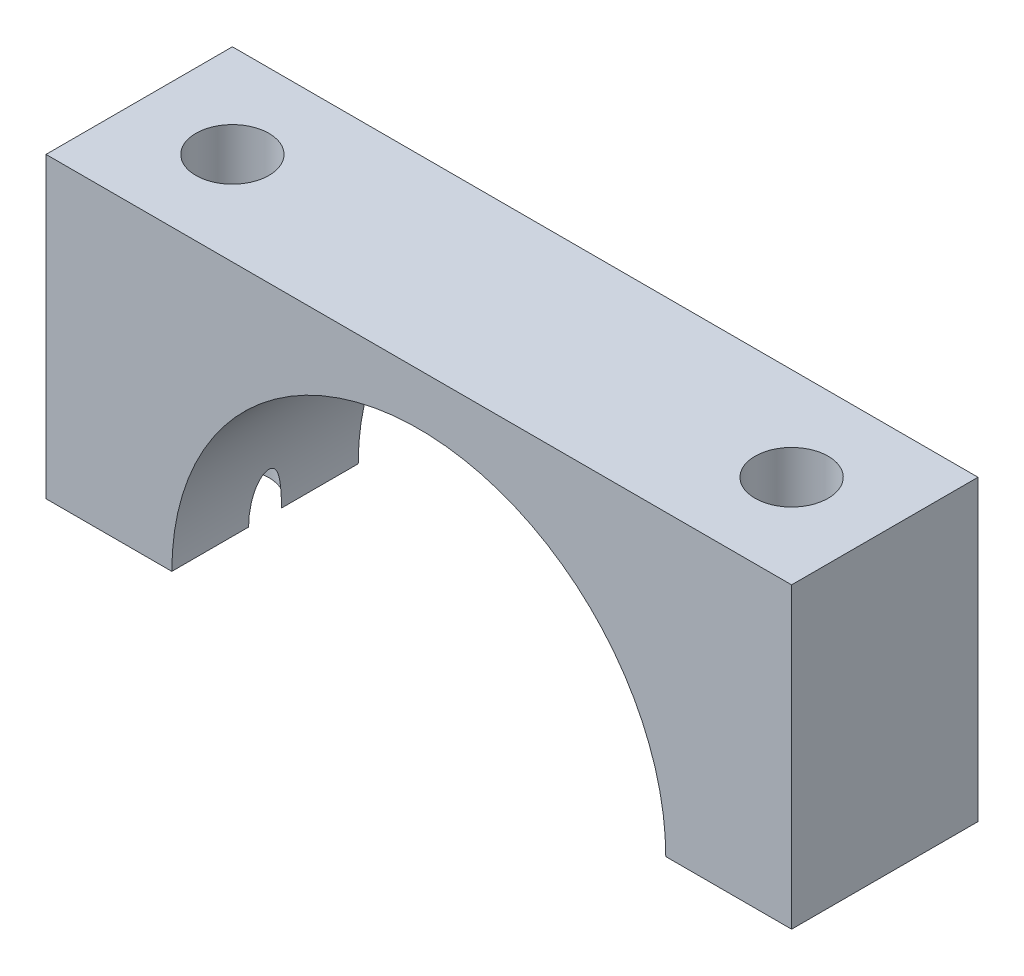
ISO-10303-21;
HEADER;
FILE_DESCRIPTION(('STEP AP214'),'2;1');
FILE_NAME('part.step','',(''),(''),'','','');
FILE_SCHEMA(('AUTOMOTIVE_DESIGN { 1 0 10303 214 1 1 1 1 }'));
ENDSEC;
DATA;
#1=APPLICATION_CONTEXT('core data for automotive mechanical design processes');
#2=APPLICATION_PROTOCOL_DEFINITION('international standard','automotive_design',2000,#1);
#3=PRODUCT_CONTEXT('',#1,'mechanical');
#4=PRODUCT('Part','Part','',(#3));
#5=PRODUCT_RELATED_PRODUCT_CATEGORY('part','',(#4));
#6=PRODUCT_DEFINITION_FORMATION('','',#4);
#7=PRODUCT_DEFINITION_CONTEXT('part definition',#1,'design');
#8=PRODUCT_DEFINITION('design','',#6,#7);
#9=PRODUCT_DEFINITION_SHAPE('','',#8);
#10=(LENGTH_UNIT() NAMED_UNIT(*) SI_UNIT(.MILLI.,.METRE.));
#11=(NAMED_UNIT(*) PLANE_ANGLE_UNIT() SI_UNIT($,.RADIAN.));
#12=(NAMED_UNIT(*) SI_UNIT($,.STERADIAN.) SOLID_ANGLE_UNIT());
#13=UNCERTAINTY_MEASURE_WITH_UNIT(LENGTH_MEASURE(1.E-05),#10,'distance_accuracy_value','');
#14=(GEOMETRIC_REPRESENTATION_CONTEXT(3) GLOBAL_UNCERTAINTY_ASSIGNED_CONTEXT((#13)) GLOBAL_UNIT_ASSIGNED_CONTEXT((#10,
#11,#12)) REPRESENTATION_CONTEXT('',''));
#15=CARTESIAN_POINT('',(0.,0.,0.));
#16=DIRECTION('',(0.,0.,1.));
#17=DIRECTION('',(1.,0.,0.));
#18=AXIS2_PLACEMENT_3D('',#15,#16,#17);
#19=CARTESIAN_POINT('',(0.,0.,12.7));
#20=DIRECTION('',(0.,1.,0.));
#21=DIRECTION('',(0.,0.,1.));
#22=AXIS2_PLACEMENT_3D('',#19,#20,#21);
#23=PLANE('',#22);
#24=DIRECTION('',(0.,0.,-1.));
#25=VECTOR('',#24,1.);
#26=CARTESIAN_POINT('',(8.57249999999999,0.,12.7));
#27=LINE('',#26,#25);
#28=CARTESIAN_POINT('',(8.57249999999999,0.,5.22901365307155));
#29=VERTEX_POINT('',#28);
#30=CARTESIAN_POINT('',(8.57249999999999,0.,0.));
#31=VERTEX_POINT('',#30);
#32=EDGE_CURVE('E43',#29,#31,#27,.T.);
#33=ORIENTED_EDGE('',*,*,#32,.F.);
#34=CARTESIAN_POINT('',(6.34999999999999,0.,6.35));
#35=DIRECTION('',(0.,1.,0.));
#36=DIRECTION('',(-1.,0.,0.));
#37=AXIS2_PLACEMENT_3D('',#34,#35,#36);
#38=CIRCLE('',#37,2.4892);
#39=CARTESIAN_POINT('',(8.57249999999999,0.,7.47098634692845));
#40=VERTEX_POINT('',#39);
#41=EDGE_CURVE('E56',#29,#40,#38,.T.);
#42=ORIENTED_EDGE('',*,*,#41,.T.);
#43=CARTESIAN_POINT('',(8.57249999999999,0.,12.7));
#44=VERTEX_POINT('',#43);
#45=EDGE_CURVE('E11',#44,#40,#27,.T.);
#46=ORIENTED_EDGE('',*,*,#45,.F.);
#47=DIRECTION('',(1.,0.,0.));
#48=VECTOR('',#47,1.);
#49=CARTESIAN_POINT('',(0.,0.,12.7));
#50=LINE('',#49,#48);
#51=CARTESIAN_POINT('',(0.,0.,12.7));
#52=VERTEX_POINT('',#51);
#53=EDGE_CURVE('E132',#52,#44,#50,.T.);
#54=ORIENTED_EDGE('',*,*,#53,.F.);
#55=DIRECTION('',(0.,0.,-1.));
#56=VECTOR('',#55,1.);
#57=CARTESIAN_POINT('',(0.,0.,12.7));
#58=LINE('',#57,#56);
#59=CARTESIAN_POINT('',(0.,0.,0.));
#60=VERTEX_POINT('',#59);
#61=EDGE_CURVE('E126',#52,#60,#58,.T.);
#62=ORIENTED_EDGE('',*,*,#61,.T.);
#63=DIRECTION('',(1.,0.,0.));
#64=VECTOR('',#63,1.);
#65=CARTESIAN_POINT('',(0.,0.,0.));
#66=LINE('',#65,#64);
#67=EDGE_CURVE('E141',#60,#31,#66,.T.);
#68=ORIENTED_EDGE('',*,*,#67,.T.);
#69=EDGE_LOOP('',(#33,#42,#46,#54,#62,#68));
#70=FACE_BOUND('',#69,.T.);
#71=ADVANCED_FACE('F36',(#70),#23,.F.);
#72=CARTESIAN_POINT('',(25.4,0.,12.7));
#73=DIRECTION('',(0.,0.,-1.));
#74=DIRECTION('',(-1.,0.,0.));
#75=AXIS2_PLACEMENT_3D('',#72,#73,#74);
#76=CYLINDRICAL_SURFACE('',#75,16.8275);
#77=DIRECTION('',(0.,0.,-1.));
#78=VECTOR('',#77,1.);
#79=CARTESIAN_POINT('',(42.2275,0.,12.7));
#80=LINE('',#79,#78);
#81=CARTESIAN_POINT('',(42.2275,0.,5.22901365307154));
#82=VERTEX_POINT('',#81);
#83=CARTESIAN_POINT('',(42.2275,0.,0.));
#84=VERTEX_POINT('',#83);
#85=EDGE_CURVE('E110',#82,#84,#80,.T.);
#86=ORIENTED_EDGE('',*,*,#85,.F.);
#87=CARTESIAN_POINT('',(42.2275,0.,5.22901365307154));
#88=CARTESIAN_POINT('',(42.22750017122,0.0725272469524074,5.22901763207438));
#89=CARTESIAN_POINT('',(42.2270310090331,0.145050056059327,5.2299427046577));
#90=CARTESIAN_POINT('',(42.2251564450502,0.290041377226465,5.23366955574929));
#91=CARTESIAN_POINT('',(42.2237509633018,0.362509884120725,5.23647149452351));
#92=CARTESIAN_POINT('',(42.2181224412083,0.580186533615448,5.24776696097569));
#93=CARTESIAN_POINT('',(42.2124873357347,0.725225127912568,5.25915056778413));
#94=CARTESIAN_POINT('',(42.1972090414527,1.02044785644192,5.2910493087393));
#95=CARTESIAN_POINT('',(42.187403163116,1.17058348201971,5.31193781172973));
#96=CARTESIAN_POINT('',(42.1639642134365,1.46850203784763,5.36459790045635));
#97=CARTESIAN_POINT('',(42.1503370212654,1.61628821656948,5.39635278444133));
#98=CARTESIAN_POINT('',(42.1274434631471,1.83374430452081,5.45431338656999));
#99=CARTESIAN_POINT('',(42.1194747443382,1.90498739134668,5.47515382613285));
#100=CARTESIAN_POINT('',(42.1027888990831,2.04612864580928,5.52095381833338));
#101=CARTESIAN_POINT('',(42.0940712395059,2.11602581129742,5.54591631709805));
#102=CARTESIAN_POINT('',(42.0761071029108,2.25321012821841,5.60061862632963));
#103=CARTESIAN_POINT('',(42.066865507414,2.32051389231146,5.63031790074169));
#104=CARTESIAN_POINT('',(42.0480358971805,2.45194558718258,5.69589246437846));
#105=CARTESIAN_POINT('',(42.0384485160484,2.51607886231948,5.73175687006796));
#106=CARTESIAN_POINT('',(42.0213405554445,2.62645126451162,5.80338362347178));
#107=CARTESIAN_POINT('',(42.0138015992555,2.67365260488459,5.83764089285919));
#108=CARTESIAN_POINT('',(41.999227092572,2.76268350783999,5.91263389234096));
#109=CARTESIAN_POINT('',(41.9921897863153,2.80453225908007,5.95334523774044));
#110=CARTESIAN_POINT('',(41.9823574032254,2.86192389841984,6.02220931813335));
#111=CARTESIAN_POINT('',(41.9790971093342,2.88072804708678,6.04755674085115));
#112=CARTESIAN_POINT('',(41.9731698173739,2.91463411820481,6.10071506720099));
#113=CARTESIAN_POINT('',(41.9705023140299,2.92973919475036,6.12852384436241));
#114=CARTESIAN_POINT('',(41.9663564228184,2.9530850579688,6.18196937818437));
#115=CARTESIAN_POINT('',(41.9647585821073,2.96202225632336,6.20728812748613));
#116=CARTESIAN_POINT('',(41.9623261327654,2.97559370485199,6.25908795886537));
#117=CARTESIAN_POINT('',(41.9614906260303,2.98023301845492,6.28556763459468));
#118=CARTESIAN_POINT('',(41.960679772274,2.98473580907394,6.33907308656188));
#119=CARTESIAN_POINT('',(41.960708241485,2.98457809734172,6.36610075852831));
#120=CARTESIAN_POINT('',(41.9616308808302,2.97945377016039,6.41968239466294));
#121=CARTESIAN_POINT('',(41.962525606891,2.97448406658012,6.44623604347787));
#122=CARTESIAN_POINT('',(41.9652647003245,2.95919397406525,6.50198279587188));
#123=CARTESIAN_POINT('',(41.9672308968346,2.9481855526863,6.53097814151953));
#124=CARTESIAN_POINT('',(41.9719262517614,2.92167717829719,6.58675954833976));
#125=CARTESIAN_POINT('',(41.9746567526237,2.90616932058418,6.61354161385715));
#126=CARTESIAN_POINT('',(41.982281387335,2.86241476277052,6.67874860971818));
#127=CARTESIAN_POINT('',(41.9875429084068,2.83183554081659,6.71554744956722));
#128=CARTESIAN_POINT('',(41.9987064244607,2.76565320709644,6.78415310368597));
#129=CARTESIAN_POINT('',(42.0046100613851,2.73003714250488,6.81594658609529));
#130=CARTESIAN_POINT('',(42.0165677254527,2.65627624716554,6.87479092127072));
#131=CARTESIAN_POINT('',(42.0226167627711,2.61819233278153,6.90192041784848));
#132=CARTESIAN_POINT('',(42.0347665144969,2.53985793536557,6.95286520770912));
#133=CARTESIAN_POINT('',(42.0408672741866,2.4996053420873,6.97667718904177));
#134=CARTESIAN_POINT('',(42.0590583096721,2.3764258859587,7.04404960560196));
#135=CARTESIAN_POINT('',(42.0710151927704,2.29121227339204,7.0834471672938));
#136=CARTESIAN_POINT('',(42.0959360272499,2.1026273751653,7.16016892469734));
#137=CARTESIAN_POINT('',(42.1087222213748,1.99864405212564,7.195984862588));
#138=CARTESIAN_POINT('',(42.1325860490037,1.7879013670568,7.2593093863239));
#139=CARTESIAN_POINT('',(42.1436615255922,1.68113869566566,7.28680752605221));
#140=CARTESIAN_POINT('',(42.1638895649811,1.46577168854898,7.33513928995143));
#141=CARTESIAN_POINT('',(42.1730388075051,1.35716451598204,7.35596143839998));
#142=CARTESIAN_POINT('',(42.189275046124,1.13885507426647,7.39193284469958));
#143=CARTESIAN_POINT('',(42.1963615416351,1.02915254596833,7.40708072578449));
#144=CARTESIAN_POINT('',(42.210747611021,0.766140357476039,7.43731514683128));
#145=CARTESIAN_POINT('',(42.2170531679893,0.612503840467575,7.45007542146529));
#146=CARTESIAN_POINT('',(42.2233313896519,0.382257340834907,7.46269013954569));
#147=CARTESIAN_POINT('',(42.2248941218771,0.305844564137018,7.46580780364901));
#148=CARTESIAN_POINT('',(42.2269784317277,0.15295673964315,7.46995354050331));
#149=CARTESIAN_POINT('',(42.2275001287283,0.0764816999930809,7.47098185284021));
#150=CARTESIAN_POINT('',(42.2275,0.,7.47098634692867));
#151=B_SPLINE_CURVE_WITH_KNOTS('',3,(#87,#88,#89,#90,#91,#92,#93,#94,#95,#96,#97,#98,#99,#100,
#101,#102,#103,#104,#105,#106,#107,#108,#109,#110,#111,#112,#113,#114,#115,#116,#117,#118,#119,
#120,#121,#122,#123,#124,#125,#126,#127,#128,#129,#130,#131,#132,#133,#134,#135,#136,#137,#138,
#139,#140,#141,#142,#143,#144,#145,#146,#147,#148,#149,#150),.UNSPECIFIED.,.F.,.F.,(4,2,2,2,2,2,
2,2,2,2,2,2,2,2,2,2,2,2,2,2,2,2,2,2,2,2,2,2,2,2,2,4),(0.,0.217565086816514,0.435148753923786,
0.871636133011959,1.32698680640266,1.78164072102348,2.00550987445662,2.22953973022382,
2.45174621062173,2.6735643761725,2.84962515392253,3.02503593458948,3.11998544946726,
3.21485371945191,3.29521686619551,3.37548521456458,3.45610816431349,3.53678288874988,
3.62950135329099,3.72238370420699,3.86597418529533,4.00994087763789,4.15117174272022,
4.29254260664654,4.57578664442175,4.90749615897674,5.23962054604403,5.57231281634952,
5.90508575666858,6.3675938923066,6.59704282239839,6.82646544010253),.UNSPECIFIED.);
#152=CARTESIAN_POINT('',(42.2275,0.,7.47098634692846));
#153=VERTEX_POINT('',#152);
#154=EDGE_CURVE('E49',#82,#153,#151,.T.);
#155=ORIENTED_EDGE('',*,*,#154,.T.);
#156=CARTESIAN_POINT('',(42.2275,0.,12.7));
#157=VERTEX_POINT('',#156);
#158=EDGE_CURVE('E107',#157,#153,#80,.T.);
#159=ORIENTED_EDGE('',*,*,#158,.F.);
#160=CARTESIAN_POINT('',(25.4,0.,12.7));
#161=DIRECTION('',(0.,0.,-1.));
#162=DIRECTION('',(-1.,0.,0.));
#163=AXIS2_PLACEMENT_3D('',#160,#161,#162);
#164=CIRCLE('',#163,16.8275);
#165=EDGE_CURVE('E151',#44,#157,#164,.T.);
#166=ORIENTED_EDGE('',*,*,#165,.F.);
#167=ORIENTED_EDGE('',*,*,#45,.T.);
#168=CARTESIAN_POINT('',(8.57249999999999,0.,7.47098634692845));
#169=CARTESIAN_POINT('',(8.57249982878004,0.0725272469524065,7.47098236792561));
#170=CARTESIAN_POINT('',(8.57296899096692,0.145050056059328,7.4700572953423));
#171=CARTESIAN_POINT('',(8.5748435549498,0.29004137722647,7.4663304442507));
#172=CARTESIAN_POINT('',(8.57624903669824,0.362509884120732,7.46352850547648));
#173=CARTESIAN_POINT('',(8.58187755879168,0.580186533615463,7.4522330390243));
#174=CARTESIAN_POINT('',(8.58751266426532,0.725225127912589,7.44084943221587));
#175=CARTESIAN_POINT('',(8.60279095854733,1.02044785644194,7.4089506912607));
#176=CARTESIAN_POINT('',(8.61259683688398,1.17058348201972,7.38806218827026));
#177=CARTESIAN_POINT('',(8.6360357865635,1.46850203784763,7.33540209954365));
#178=CARTESIAN_POINT('',(8.64966297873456,1.61628821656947,7.30364721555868));
#179=CARTESIAN_POINT('',(8.67255653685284,1.8337443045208,7.24568661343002));
#180=CARTESIAN_POINT('',(8.68052525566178,1.90498739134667,7.22484617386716));
#181=CARTESIAN_POINT('',(8.6972111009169,2.04612864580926,7.17904618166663));
#182=CARTESIAN_POINT('',(8.70592876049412,2.11602581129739,7.15408368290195));
#183=CARTESIAN_POINT('',(8.72389289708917,2.25321012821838,7.09938137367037));
#184=CARTESIAN_POINT('',(8.73313449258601,2.32051389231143,7.06968209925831));
#185=CARTESIAN_POINT('',(8.75196410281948,2.45194558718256,7.00410753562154));
#186=CARTESIAN_POINT('',(8.76155148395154,2.51607886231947,6.96824312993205));
#187=CARTESIAN_POINT('',(8.77865944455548,2.62645126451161,6.89661637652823));
#188=CARTESIAN_POINT('',(8.78619840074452,2.67365260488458,6.86235910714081));
#189=CARTESIAN_POINT('',(8.800772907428,2.76268350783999,6.78736610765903));
#190=CARTESIAN_POINT('',(8.80781021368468,2.80453225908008,6.74665476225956));
#191=CARTESIAN_POINT('',(8.81764259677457,2.86192389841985,6.67779068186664));
#192=CARTESIAN_POINT('',(8.82090289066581,2.88072804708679,6.65244325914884));
#193=CARTESIAN_POINT('',(8.82683018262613,2.91463411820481,6.599284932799));
#194=CARTESIAN_POINT('',(8.82949768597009,2.92973919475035,6.57147615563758));
#195=CARTESIAN_POINT('',(8.83364357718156,2.95308505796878,6.51803062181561));
#196=CARTESIAN_POINT('',(8.83524141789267,2.96202225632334,6.49271187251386));
#197=CARTESIAN_POINT('',(8.83767386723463,2.97559370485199,6.44091204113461));
#198=CARTESIAN_POINT('',(8.83850937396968,2.98023301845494,6.41443236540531));
#199=CARTESIAN_POINT('',(8.83932022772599,2.98473580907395,6.36092691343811));
#200=CARTESIAN_POINT('',(8.83929175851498,2.9845780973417,6.33389924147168));
#201=CARTESIAN_POINT('',(8.8383691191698,2.97945377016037,6.28031760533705));
#202=CARTESIAN_POINT('',(8.83747439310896,2.97448406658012,6.25376395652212));
#203=CARTESIAN_POINT('',(8.83473529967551,2.95919397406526,6.19801720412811));
#204=CARTESIAN_POINT('',(8.83276910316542,2.9481855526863,6.16902185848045));
#205=CARTESIAN_POINT('',(8.82807374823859,2.92167717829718,6.11324045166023));
#206=CARTESIAN_POINT('',(8.82534324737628,2.90616932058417,6.08645838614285));
#207=CARTESIAN_POINT('',(8.81771861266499,2.86241476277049,6.02125139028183));
#208=CARTESIAN_POINT('',(8.81245709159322,2.83183554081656,5.98445255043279));
#209=CARTESIAN_POINT('',(8.80129357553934,2.76565320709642,5.91584689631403));
#210=CARTESIAN_POINT('',(8.79538993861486,2.73003714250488,5.88405341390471));
#211=CARTESIAN_POINT('',(8.78343227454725,2.65627624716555,5.82520907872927));
#212=CARTESIAN_POINT('',(8.77738323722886,2.61819233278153,5.79807958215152));
#213=CARTESIAN_POINT('',(8.76523348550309,2.53985793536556,5.74713479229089));
#214=CARTESIAN_POINT('',(8.75913272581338,2.4996053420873,5.72332281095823));
#215=CARTESIAN_POINT('',(8.74094169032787,2.3764258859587,5.65595039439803));
#216=CARTESIAN_POINT('',(8.72898480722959,2.29121227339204,5.6165528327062));
#217=CARTESIAN_POINT('',(8.70406397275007,2.1026273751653,5.53983107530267));
#218=CARTESIAN_POINT('',(8.69127777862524,1.99864405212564,5.504015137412));
#219=CARTESIAN_POINT('',(8.66741395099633,1.7879013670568,5.44069061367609));
#220=CARTESIAN_POINT('',(8.65633847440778,1.68113869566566,5.41319247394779));
#221=CARTESIAN_POINT('',(8.63611043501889,1.46577168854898,5.36486071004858));
#222=CARTESIAN_POINT('',(8.62696119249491,1.35716451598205,5.34403856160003));
#223=CARTESIAN_POINT('',(8.61072495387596,1.13885507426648,5.30806715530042));
#224=CARTESIAN_POINT('',(8.60363845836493,1.02915254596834,5.29291927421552));
#225=CARTESIAN_POINT('',(8.58925238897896,0.766140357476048,5.26268485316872));
#226=CARTESIAN_POINT('',(8.58294683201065,0.612503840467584,5.24992457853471));
#227=CARTESIAN_POINT('',(8.5766686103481,0.382257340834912,5.2373098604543));
#228=CARTESIAN_POINT('',(8.57510587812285,0.305844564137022,5.23419219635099));
#229=CARTESIAN_POINT('',(8.57302156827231,0.152956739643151,5.23004645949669));
#230=CARTESIAN_POINT('',(8.57249987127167,0.0764816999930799,5.22901814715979));
#231=CARTESIAN_POINT('',(8.57249999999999,0.,5.22901365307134));
#232=B_SPLINE_CURVE_WITH_KNOTS('',3,(#168,#169,#170,#171,#172,#173,#174,#175,#176,#177,#178,
#179,#180,#181,#182,#183,#184,#185,#186,#187,#188,#189,#190,#191,#192,#193,#194,#195,#196,#197,
#198,#199,#200,#201,#202,#203,#204,#205,#206,#207,#208,#209,#210,#211,#212,#213,#214,#215,#216,
#217,#218,#219,#220,#221,#222,#223,#224,#225,#226,#227,#228,#229,#230,#231),.UNSPECIFIED.,.F.,
.F.,(4,2,2,2,2,2,2,2,2,2,2,2,2,2,2,2,2,2,2,2,2,2,2,2,2,2,2,2,2,2,2,4),(0.,0.21756508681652,
0.435148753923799,0.871636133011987,1.32698680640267,1.78164072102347,2.0055098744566,
2.2295397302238,2.45174621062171,2.67356437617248,2.84962515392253,3.0250359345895,
3.11998544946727,3.21485371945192,3.29521686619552,3.37548521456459,3.45610816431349,
3.53678288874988,3.629501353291,3.722383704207,3.86597418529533,4.00994087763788,
4.15117174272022,4.29254260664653,4.57578664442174,4.90749615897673,5.23962054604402,
5.57231281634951,5.90508575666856,6.36759389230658,6.59704282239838,6.82646544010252),.UNSPECIFIED.);
#233=EDGE_CURVE('E144',#40,#29,#232,.T.);
#234=ORIENTED_EDGE('',*,*,#233,.T.);
#235=ORIENTED_EDGE('',*,*,#32,.T.);
#236=CARTESIAN_POINT('',(25.4,0.,0.));
#237=DIRECTION('',(0.,0.,-1.));
#238=DIRECTION('',(-1.,0.,0.));
#239=AXIS2_PLACEMENT_3D('',#236,#237,#238);
#240=CIRCLE('',#239,16.8275);
#241=EDGE_CURVE('E139',#31,#84,#240,.T.);
#242=ORIENTED_EDGE('',*,*,#241,.T.);
#243=EDGE_LOOP('',(#86,#155,#159,#166,#167,#234,#235,#242));
#244=FACE_BOUND('',#243,.T.);
#245=ADVANCED_FACE('F106',(#244),#76,.F.);
#246=CARTESIAN_POINT('',(42.2275,0.,12.7));
#247=DIRECTION('',(0.,1.,0.));
#248=DIRECTION('',(-1.,0.,0.));
#249=AXIS2_PLACEMENT_3D('',#246,#247,#248);
#250=PLANE('',#249);
#251=ORIENTED_EDGE('',*,*,#158,.T.);
#252=CARTESIAN_POINT('',(44.45,0.,6.35));
#253=DIRECTION('',(0.,1.,0.));
#254=DIRECTION('',(-1.,0.,0.));
#255=AXIS2_PLACEMENT_3D('',#252,#253,#254);
#256=CIRCLE('',#255,2.4892);
#257=EDGE_CURVE('E97',#153,#82,#256,.T.);
#258=ORIENTED_EDGE('',*,*,#257,.T.);
#259=ORIENTED_EDGE('',*,*,#85,.T.);
#260=DIRECTION('',(1.,0.,0.));
#261=VECTOR('',#260,1.);
#262=CARTESIAN_POINT('',(42.2275,0.,0.));
#263=LINE('',#262,#261);
#264=CARTESIAN_POINT('',(50.8,0.,0.));
#265=VERTEX_POINT('',#264);
#266=EDGE_CURVE('E137',#84,#265,#263,.T.);
#267=ORIENTED_EDGE('',*,*,#266,.T.);
#268=DIRECTION('',(0.,0.,-1.));
#269=VECTOR('',#268,1.);
#270=CARTESIAN_POINT('',(50.8,0.,12.7));
#271=LINE('',#270,#269);
#272=CARTESIAN_POINT('',(50.8,0.,12.7));
#273=VERTEX_POINT('',#272);
#274=EDGE_CURVE('E116',#273,#265,#271,.T.);
#275=ORIENTED_EDGE('',*,*,#274,.F.);
#276=DIRECTION('',(1.,0.,0.));
#277=VECTOR('',#276,1.);
#278=CARTESIAN_POINT('',(42.2275,0.,12.7));
#279=LINE('',#278,#277);
#280=EDGE_CURVE('E115',#157,#273,#279,.T.);
#281=ORIENTED_EDGE('',*,*,#280,.F.);
#282=EDGE_LOOP('',(#251,#258,#259,#267,#275,#281));
#283=FACE_BOUND('',#282,.T.);
#284=ADVANCED_FACE('F113',(#283),#250,.F.);
#285=CARTESIAN_POINT('',(50.8,0.,12.7));
#286=DIRECTION('',(-1.,0.,0.));
#287=DIRECTION('',(0.,-1.,0.));
#288=AXIS2_PLACEMENT_3D('',#285,#286,#287);
#289=PLANE('',#288);
#290=DIRECTION('',(0.,1.,0.));
#291=VECTOR('',#290,1.);
#292=CARTESIAN_POINT('',(50.8,0.,0.));
#293=LINE('',#292,#291);
#294=CARTESIAN_POINT('',(50.8,20.32,0.));
#295=VERTEX_POINT('',#294);
#296=EDGE_CURVE('E135',#265,#295,#293,.T.);
#297=ORIENTED_EDGE('',*,*,#296,.T.);
#298=DIRECTION('',(0.,0.,-1.));
#299=VECTOR('',#298,1.);
#300=CARTESIAN_POINT('',(50.8,20.32,12.7));
#301=LINE('',#300,#299);
#302=CARTESIAN_POINT('',(50.8,20.32,12.7));
#303=VERTEX_POINT('',#302);
#304=EDGE_CURVE('E120',#303,#295,#301,.T.);
#305=ORIENTED_EDGE('',*,*,#304,.F.);
#306=DIRECTION('',(0.,1.,0.));
#307=VECTOR('',#306,1.);
#308=CARTESIAN_POINT('',(50.8,0.,12.7));
#309=LINE('',#308,#307);
#310=EDGE_CURVE('E148',#273,#303,#309,.T.);
#311=ORIENTED_EDGE('',*,*,#310,.F.);
#312=ORIENTED_EDGE('',*,*,#274,.T.);
#313=EDGE_LOOP('',(#297,#305,#311,#312));
#314=FACE_BOUND('',#313,.T.);
#315=ADVANCED_FACE('F185',(#314),#289,.F.);
#316=CARTESIAN_POINT('',(0.,20.32,12.7));
#317=DIRECTION('',(0.,-1.,0.));
#318=DIRECTION('',(1.,0.,0.));
#319=AXIS2_PLACEMENT_3D('',#316,#317,#318);
#320=PLANE('',#319);
#321=CARTESIAN_POINT('',(44.45,20.32,6.35));
#322=DIRECTION('',(0.,1.,0.));
#323=DIRECTION('',(-1.,0.,0.));
#324=AXIS2_PLACEMENT_3D('',#321,#322,#323);
#325=CIRCLE('',#324,2.4892);
#326=CARTESIAN_POINT('',(41.9608,20.32,6.35));
#327=VERTEX_POINT('',#326);
#328=EDGE_CURVE('E102',#327,#327,#325,.T.);
#329=ORIENTED_EDGE('',*,*,#328,.F.);
#330=EDGE_LOOP('',(#329));
#331=FACE_BOUND('',#330,.T.);
#332=CARTESIAN_POINT('',(6.34999999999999,20.32,6.35));
#333=DIRECTION('',(0.,1.,0.));
#334=DIRECTION('',(-1.,0.,0.));
#335=AXIS2_PLACEMENT_3D('',#332,#333,#334);
#336=CIRCLE('',#335,2.4892);
#337=CARTESIAN_POINT('',(3.86079999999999,20.32,6.35));
#338=VERTEX_POINT('',#337);
#339=EDGE_CURVE('E111',#338,#338,#336,.T.);
#340=ORIENTED_EDGE('',*,*,#339,.F.);
#341=EDGE_LOOP('',(#340));
#342=FACE_BOUND('',#341,.T.);
#343=DIRECTION('',(-1.,0.,0.));
#344=VECTOR('',#343,1.);
#345=CARTESIAN_POINT('',(0.,20.32,0.));
#346=LINE('',#345,#344);
#347=CARTESIAN_POINT('',(0.,20.32,0.));
#348=VERTEX_POINT('',#347);
#349=EDGE_CURVE('E133',#295,#348,#346,.T.);
#350=ORIENTED_EDGE('',*,*,#349,.T.);
#351=DIRECTION('',(0.,0.,-1.));
#352=VECTOR('',#351,1.);
#353=CARTESIAN_POINT('',(0.,20.32,12.7));
#354=LINE('',#353,#352);
#355=CARTESIAN_POINT('',(0.,20.32,12.7));
#356=VERTEX_POINT('',#355);
#357=EDGE_CURVE('E123',#356,#348,#354,.T.);
#358=ORIENTED_EDGE('',*,*,#357,.F.);
#359=DIRECTION('',(-1.,0.,0.));
#360=VECTOR('',#359,1.);
#361=CARTESIAN_POINT('',(0.,20.32,12.7));
#362=LINE('',#361,#360);
#363=EDGE_CURVE('E146',#303,#356,#362,.T.);
#364=ORIENTED_EDGE('',*,*,#363,.F.);
#365=ORIENTED_EDGE('',*,*,#304,.T.);
#366=EDGE_LOOP('',(#350,#358,#364,#365));
#367=FACE_BOUND('',#366,.T.);
#368=ADVANCED_FACE('F181',(#331,#342,#367),#320,.F.);
#369=CARTESIAN_POINT('',(0.,0.,12.7));
#370=DIRECTION('',(1.,0.,0.));
#371=DIRECTION('',(0.,0.,-1.));
#372=AXIS2_PLACEMENT_3D('',#369,#370,#371);
#373=PLANE('',#372);
#374=DIRECTION('',(0.,-1.,0.));
#375=VECTOR('',#374,1.);
#376=CARTESIAN_POINT('',(0.,0.,0.));
#377=LINE('',#376,#375);
#378=EDGE_CURVE('E130',#348,#60,#377,.T.);
#379=ORIENTED_EDGE('',*,*,#378,.T.);
#380=ORIENTED_EDGE('',*,*,#61,.F.);
#381=DIRECTION('',(0.,-1.,0.));
#382=VECTOR('',#381,1.);
#383=CARTESIAN_POINT('',(0.,0.,12.7));
#384=LINE('',#383,#382);
#385=EDGE_CURVE('E129',#356,#52,#384,.T.);
#386=ORIENTED_EDGE('',*,*,#385,.F.);
#387=ORIENTED_EDGE('',*,*,#357,.T.);
#388=EDGE_LOOP('',(#379,#380,#386,#387));
#389=FACE_BOUND('',#388,.T.);
#390=ADVANCED_FACE('F174',(#389),#373,.F.);
#391=CARTESIAN_POINT('',(25.4,0.,12.7));
#392=DIRECTION('',(0.,0.,-1.));
#393=DIRECTION('',(-1.,0.,0.));
#394=AXIS2_PLACEMENT_3D('',#391,#392,#393);
#395=PLANE('',#394);
#396=ORIENTED_EDGE('',*,*,#53,.T.);
#397=ORIENTED_EDGE('',*,*,#165,.T.);
#398=ORIENTED_EDGE('',*,*,#280,.T.);
#399=ORIENTED_EDGE('',*,*,#310,.T.);
#400=ORIENTED_EDGE('',*,*,#363,.T.);
#401=ORIENTED_EDGE('',*,*,#385,.T.);
#402=EDGE_LOOP('',(#396,#397,#398,#399,#400,#401));
#403=FACE_BOUND('',#402,.T.);
#404=ADVANCED_FACE('F171',(#403),#395,.F.);
#405=CARTESIAN_POINT('',(25.4,0.,0.));
#406=DIRECTION('',(0.,0.,-1.));
#407=DIRECTION('',(-1.,0.,0.));
#408=AXIS2_PLACEMENT_3D('',#405,#406,#407);
#409=PLANE('',#408);
#410=ORIENTED_EDGE('',*,*,#67,.F.);
#411=ORIENTED_EDGE('',*,*,#378,.F.);
#412=ORIENTED_EDGE('',*,*,#349,.F.);
#413=ORIENTED_EDGE('',*,*,#296,.F.);
#414=ORIENTED_EDGE('',*,*,#266,.F.);
#415=ORIENTED_EDGE('',*,*,#241,.F.);
#416=EDGE_LOOP('',(#410,#411,#412,#413,#414,#415));
#417=FACE_BOUND('',#416,.T.);
#418=ADVANCED_FACE('F168',(#417),#409,.T.);
#419=CARTESIAN_POINT('',(6.34999999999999,0.,6.35));
#420=DIRECTION('',(0.,1.,0.));
#421=DIRECTION('',(-1.,0.,0.));
#422=AXIS2_PLACEMENT_3D('',#419,#420,#421);
#423=CYLINDRICAL_SURFACE('',#422,2.4892);
#424=ORIENTED_EDGE('',*,*,#339,.T.);
#425=EDGE_LOOP('',(#424));
#426=FACE_BOUND('',#425,.T.);
#427=ORIENTED_EDGE('',*,*,#41,.F.);
#428=ORIENTED_EDGE('',*,*,#233,.F.);
#429=EDGE_LOOP('',(#427,#428));
#430=FACE_BOUND('',#429,.T.);
#431=ADVANCED_FACE('F163',(#426,#430),#423,.F.);
#432=CARTESIAN_POINT('',(44.45,0.,6.35));
#433=DIRECTION('',(0.,1.,0.));
#434=DIRECTION('',(-1.,0.,0.));
#435=AXIS2_PLACEMENT_3D('',#432,#433,#434);
#436=CYLINDRICAL_SURFACE('',#435,2.4892);
#437=ORIENTED_EDGE('',*,*,#328,.T.);
#438=EDGE_LOOP('',(#437));
#439=FACE_BOUND('',#438,.T.);
#440=ORIENTED_EDGE('',*,*,#257,.F.);
#441=ORIENTED_EDGE('',*,*,#154,.F.);
#442=EDGE_LOOP('',(#440,#441));
#443=FACE_BOUND('',#442,.T.);
#444=ADVANCED_FACE('F98',(#439,#443),#436,.F.);
#445=CLOSED_SHELL('',(#71,#245,#284,#315,#368,#390,#404,#418,#431,#444));
#446=MANIFOLD_SOLID_BREP('B2',#445);
#447=ADVANCED_BREP_SHAPE_REPRESENTATION('',(#18,#446),#14);
#448=SHAPE_DEFINITION_REPRESENTATION(#9,#447);
ENDSEC;
END-ISO-10303-21;
